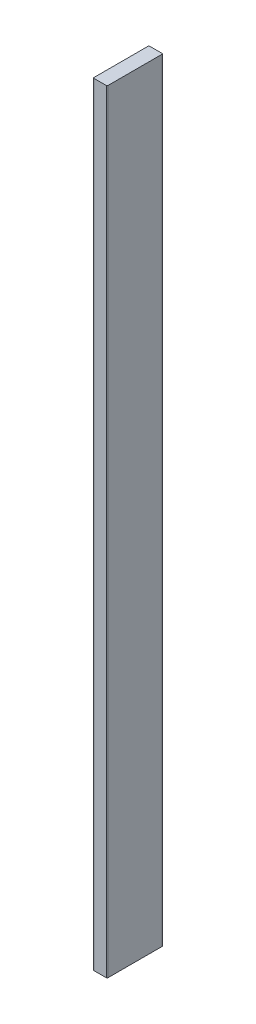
ISO-10303-21;
HEADER;
FILE_DESCRIPTION(('STEP AP214'),'2;1');
FILE_NAME('part.step','',(''),(''),'','','');
FILE_SCHEMA(('AUTOMOTIVE_DESIGN { 1 0 10303 214 1 1 1 1 }'));
ENDSEC;
DATA;
#1=APPLICATION_CONTEXT('core data for automotive mechanical design processes');
#2=APPLICATION_PROTOCOL_DEFINITION('international standard','automotive_design',2000,#1);
#3=PRODUCT_CONTEXT('',#1,'mechanical');
#4=PRODUCT('Part','Part','',(#3));
#5=PRODUCT_RELATED_PRODUCT_CATEGORY('part','',(#4));
#6=PRODUCT_DEFINITION_FORMATION('','',#4);
#7=PRODUCT_DEFINITION_CONTEXT('part definition',#1,'design');
#8=PRODUCT_DEFINITION('design','',#6,#7);
#9=PRODUCT_DEFINITION_SHAPE('','',#8);
#10=(LENGTH_UNIT() NAMED_UNIT(*) SI_UNIT(.MILLI.,.METRE.));
#11=(NAMED_UNIT(*) PLANE_ANGLE_UNIT() SI_UNIT($,.RADIAN.));
#12=(NAMED_UNIT(*) SI_UNIT($,.STERADIAN.) SOLID_ANGLE_UNIT());
#13=UNCERTAINTY_MEASURE_WITH_UNIT(LENGTH_MEASURE(1.E-05),#10,'distance_accuracy_value','');
#14=(GEOMETRIC_REPRESENTATION_CONTEXT(3) GLOBAL_UNCERTAINTY_ASSIGNED_CONTEXT((#13)) GLOBAL_UNIT_ASSIGNED_CONTEXT((#10,
#11,#12)) REPRESENTATION_CONTEXT('',''));
#15=CARTESIAN_POINT('',(0.,0.,0.));
#16=DIRECTION('',(0.,0.,1.));
#17=DIRECTION('',(1.,0.,0.));
#18=AXIS2_PLACEMENT_3D('',#15,#16,#17);
#19=CARTESIAN_POINT('',(-4.5,-277.5,19.5));
#20=DIRECTION('',(0.,1.,0.));
#21=DIRECTION('',(0.,0.,1.));
#22=AXIS2_PLACEMENT_3D('',#19,#20,#21);
#23=CYLINDRICAL_SURFACE('',#22,0.5);
#24=CARTESIAN_POINT('',(-4.5,277.5,19.5));
#25=DIRECTION('',(0.,1.,0.));
#26=DIRECTION('',(0.,0.,1.));
#27=AXIS2_PLACEMENT_3D('',#24,#25,#26);
#28=CIRCLE('',#27,0.5);
#29=CARTESIAN_POINT('',(-5.,277.5,19.5));
#30=VERTEX_POINT('',#29);
#31=CARTESIAN_POINT('',(-4.5,277.5,20.));
#32=VERTEX_POINT('',#31);
#33=EDGE_CURVE('E132',#30,#32,#28,.T.);
#34=ORIENTED_EDGE('',*,*,#33,.F.);
#35=DIRECTION('',(0.,1.,0.));
#36=VECTOR('',#35,1.);
#37=CARTESIAN_POINT('',(-5.,-277.5,19.5));
#38=LINE('',#37,#36);
#39=CARTESIAN_POINT('',(-5.,-277.5,19.5));
#40=VERTEX_POINT('',#39);
#41=EDGE_CURVE('E11',#40,#30,#38,.T.);
#42=ORIENTED_EDGE('',*,*,#41,.F.);
#43=CARTESIAN_POINT('',(-4.5,-277.5,19.5));
#44=DIRECTION('',(0.,1.,0.));
#45=DIRECTION('',(0.,0.,1.));
#46=AXIS2_PLACEMENT_3D('',#43,#44,#45);
#47=CIRCLE('',#46,0.5);
#48=CARTESIAN_POINT('',(-4.5,-277.5,20.));
#49=VERTEX_POINT('',#48);
#50=EDGE_CURVE('E152',#40,#49,#47,.T.);
#51=ORIENTED_EDGE('',*,*,#50,.T.);
#52=DIRECTION('',(0.,1.,0.));
#53=VECTOR('',#52,1.);
#54=CARTESIAN_POINT('',(-4.5,-277.5,20.));
#55=LINE('',#54,#53);
#56=EDGE_CURVE('E38',#49,#32,#55,.T.);
#57=ORIENTED_EDGE('',*,*,#56,.T.);
#58=EDGE_LOOP('',(#34,#42,#51,#57));
#59=FACE_BOUND('',#58,.T.);
#60=ADVANCED_FACE('F35',(#59),#23,.T.);
#61=CARTESIAN_POINT('',(-5.,-277.5,-19.5));
#62=DIRECTION('',(-1.,0.,0.));
#63=DIRECTION('',(0.,0.,1.));
#64=AXIS2_PLACEMENT_3D('',#61,#62,#63);
#65=PLANE('',#64);
#66=DIRECTION('',(0.,0.,1.));
#67=VECTOR('',#66,1.);
#68=CARTESIAN_POINT('',(-5.,277.5,-19.5));
#69=LINE('',#68,#67);
#70=CARTESIAN_POINT('',(-5.,277.5,-19.5));
#71=VERTEX_POINT('',#70);
#72=EDGE_CURVE('E150',#71,#30,#69,.T.);
#73=ORIENTED_EDGE('',*,*,#72,.F.);
#74=DIRECTION('',(0.,1.,0.));
#75=VECTOR('',#74,1.);
#76=CARTESIAN_POINT('',(-5.,-277.5,-19.5));
#77=LINE('',#76,#75);
#78=CARTESIAN_POINT('',(-5.,-277.5,-19.5));
#79=VERTEX_POINT('',#78);
#80=EDGE_CURVE('E44',#79,#71,#77,.T.);
#81=ORIENTED_EDGE('',*,*,#80,.F.);
#82=DIRECTION('',(0.,0.,1.));
#83=VECTOR('',#82,1.);
#84=CARTESIAN_POINT('',(-5.,-277.5,-19.5));
#85=LINE('',#84,#83);
#86=EDGE_CURVE('E122',#79,#40,#85,.T.);
#87=ORIENTED_EDGE('',*,*,#86,.T.);
#88=ORIENTED_EDGE('',*,*,#41,.T.);
#89=EDGE_LOOP('',(#73,#81,#87,#88));
#90=FACE_BOUND('',#89,.T.);
#91=ADVANCED_FACE('F164',(#90),#65,.T.);
#92=CARTESIAN_POINT('',(-4.5,-277.5,-19.5));
#93=DIRECTION('',(0.,1.,0.));
#94=DIRECTION('',(0.,0.,1.));
#95=AXIS2_PLACEMENT_3D('',#92,#93,#94);
#96=CYLINDRICAL_SURFACE('',#95,0.5);
#97=CARTESIAN_POINT('',(-4.5,277.5,-19.5));
#98=DIRECTION('',(0.,1.,0.));
#99=DIRECTION('',(0.,0.,1.));
#100=AXIS2_PLACEMENT_3D('',#97,#98,#99);
#101=CIRCLE('',#100,0.5);
#102=CARTESIAN_POINT('',(-4.5,277.5,-20.));
#103=VERTEX_POINT('',#102);
#104=EDGE_CURVE('E109',#103,#71,#101,.T.);
#105=ORIENTED_EDGE('',*,*,#104,.F.);
#106=DIRECTION('',(0.,1.,0.));
#107=VECTOR('',#106,1.);
#108=CARTESIAN_POINT('',(-4.5,-277.5,-20.));
#109=LINE('',#108,#107);
#110=CARTESIAN_POINT('',(-4.5,-277.5,-20.));
#111=VERTEX_POINT('',#110);
#112=EDGE_CURVE('E104',#111,#103,#109,.T.);
#113=ORIENTED_EDGE('',*,*,#112,.F.);
#114=CARTESIAN_POINT('',(-4.5,-277.5,-19.5));
#115=DIRECTION('',(0.,1.,0.));
#116=DIRECTION('',(0.,0.,1.));
#117=AXIS2_PLACEMENT_3D('',#114,#115,#116);
#118=CIRCLE('',#117,0.5);
#119=EDGE_CURVE('E107',#111,#79,#118,.T.);
#120=ORIENTED_EDGE('',*,*,#119,.T.);
#121=ORIENTED_EDGE('',*,*,#80,.T.);
#122=EDGE_LOOP('',(#105,#113,#120,#121));
#123=FACE_BOUND('',#122,.T.);
#124=ADVANCED_FACE('F106',(#123),#96,.T.);
#125=CARTESIAN_POINT('',(4.5,-277.5,-20.));
#126=DIRECTION('',(0.,0.,-1.));
#127=DIRECTION('',(-1.,0.,0.));
#128=AXIS2_PLACEMENT_3D('',#125,#126,#127);
#129=PLANE('',#128);
#130=DIRECTION('',(-1.,0.,0.));
#131=VECTOR('',#130,1.);
#132=CARTESIAN_POINT('',(4.5,277.5,-20.));
#133=LINE('',#132,#131);
#134=CARTESIAN_POINT('',(4.5,277.5,-20.));
#135=VERTEX_POINT('',#134);
#136=EDGE_CURVE('E147',#135,#103,#133,.T.);
#137=ORIENTED_EDGE('',*,*,#136,.F.);
#138=DIRECTION('',(0.,1.,0.));
#139=VECTOR('',#138,1.);
#140=CARTESIAN_POINT('',(4.5,-277.5,-20.));
#141=LINE('',#140,#139);
#142=CARTESIAN_POINT('',(4.5,-277.5,-20.));
#143=VERTEX_POINT('',#142);
#144=EDGE_CURVE('E114',#143,#135,#141,.T.);
#145=ORIENTED_EDGE('',*,*,#144,.F.);
#146=DIRECTION('',(-1.,0.,0.));
#147=VECTOR('',#146,1.);
#148=CARTESIAN_POINT('',(4.5,-277.5,-20.));
#149=LINE('',#148,#147);
#150=EDGE_CURVE('E120',#143,#111,#149,.T.);
#151=ORIENTED_EDGE('',*,*,#150,.T.);
#152=ORIENTED_EDGE('',*,*,#112,.T.);
#153=EDGE_LOOP('',(#137,#145,#151,#152));
#154=FACE_BOUND('',#153,.T.);
#155=ADVANCED_FACE('F124',(#154),#129,.T.);
#156=CARTESIAN_POINT('',(4.5,-277.5,-19.5));
#157=DIRECTION('',(0.,1.,0.));
#158=DIRECTION('',(0.,0.,1.));
#159=AXIS2_PLACEMENT_3D('',#156,#157,#158);
#160=CYLINDRICAL_SURFACE('',#159,0.5);
#161=CARTESIAN_POINT('',(4.5,277.5,-19.5));
#162=DIRECTION('',(0.,1.,0.));
#163=DIRECTION('',(0.,0.,1.));
#164=AXIS2_PLACEMENT_3D('',#161,#162,#163);
#165=CIRCLE('',#164,0.5);
#166=CARTESIAN_POINT('',(5.,277.5,-19.5));
#167=VERTEX_POINT('',#166);
#168=EDGE_CURVE('E144',#167,#135,#165,.T.);
#169=ORIENTED_EDGE('',*,*,#168,.F.);
#170=DIRECTION('',(0.,1.,0.));
#171=VECTOR('',#170,1.);
#172=CARTESIAN_POINT('',(5.,-277.5,-19.5));
#173=LINE('',#172,#171);
#174=CARTESIAN_POINT('',(5.,-277.5,-19.5));
#175=VERTEX_POINT('',#174);
#176=EDGE_CURVE('E156',#175,#167,#173,.T.);
#177=ORIENTED_EDGE('',*,*,#176,.F.);
#178=CARTESIAN_POINT('',(4.5,-277.5,-19.5));
#179=DIRECTION('',(0.,1.,0.));
#180=DIRECTION('',(0.,0.,1.));
#181=AXIS2_PLACEMENT_3D('',#178,#179,#180);
#182=CIRCLE('',#181,0.5);
#183=EDGE_CURVE('E125',#175,#143,#182,.T.);
#184=ORIENTED_EDGE('',*,*,#183,.T.);
#185=ORIENTED_EDGE('',*,*,#144,.T.);
#186=EDGE_LOOP('',(#169,#177,#184,#185));
#187=FACE_BOUND('',#186,.T.);
#188=ADVANCED_FACE('F177',(#187),#160,.T.);
#189=CARTESIAN_POINT('',(5.,-277.5,19.5));
#190=DIRECTION('',(1.,0.,0.));
#191=DIRECTION('',(0.,0.,-1.));
#192=AXIS2_PLACEMENT_3D('',#189,#190,#191);
#193=PLANE('',#192);
#194=DIRECTION('',(0.,0.,-1.));
#195=VECTOR('',#194,1.);
#196=CARTESIAN_POINT('',(5.,277.5,19.5));
#197=LINE('',#196,#195);
#198=CARTESIAN_POINT('',(5.,277.5,19.5));
#199=VERTEX_POINT('',#198);
#200=EDGE_CURVE('E141',#199,#167,#197,.T.);
#201=ORIENTED_EDGE('',*,*,#200,.F.);
#202=DIRECTION('',(0.,1.,0.));
#203=VECTOR('',#202,1.);
#204=CARTESIAN_POINT('',(5.,-277.5,19.5));
#205=LINE('',#204,#203);
#206=CARTESIAN_POINT('',(5.,-277.5,19.5));
#207=VERTEX_POINT('',#206);
#208=EDGE_CURVE('E158',#207,#199,#205,.T.);
#209=ORIENTED_EDGE('',*,*,#208,.F.);
#210=DIRECTION('',(0.,0.,-1.));
#211=VECTOR('',#210,1.);
#212=CARTESIAN_POINT('',(5.,-277.5,19.5));
#213=LINE('',#212,#211);
#214=EDGE_CURVE('E127',#207,#175,#213,.T.);
#215=ORIENTED_EDGE('',*,*,#214,.T.);
#216=ORIENTED_EDGE('',*,*,#176,.T.);
#217=EDGE_LOOP('',(#201,#209,#215,#216));
#218=FACE_BOUND('',#217,.T.);
#219=ADVANCED_FACE('F180',(#218),#193,.T.);
#220=CARTESIAN_POINT('',(4.5,-277.5,19.5));
#221=DIRECTION('',(0.,1.,0.));
#222=DIRECTION('',(0.,0.,1.));
#223=AXIS2_PLACEMENT_3D('',#220,#221,#222);
#224=CYLINDRICAL_SURFACE('',#223,0.5);
#225=CARTESIAN_POINT('',(4.5,277.5,19.5));
#226=DIRECTION('',(0.,1.,0.));
#227=DIRECTION('',(0.,0.,1.));
#228=AXIS2_PLACEMENT_3D('',#225,#226,#227);
#229=CIRCLE('',#228,0.5);
#230=CARTESIAN_POINT('',(4.5,277.5,20.));
#231=VERTEX_POINT('',#230);
#232=EDGE_CURVE('E138',#231,#199,#229,.T.);
#233=ORIENTED_EDGE('',*,*,#232,.F.);
#234=DIRECTION('',(0.,1.,0.));
#235=VECTOR('',#234,1.);
#236=CARTESIAN_POINT('',(4.5,-277.5,20.));
#237=LINE('',#236,#235);
#238=CARTESIAN_POINT('',(4.5,-277.5,20.));
#239=VERTEX_POINT('',#238);
#240=EDGE_CURVE('E159',#239,#231,#237,.T.);
#241=ORIENTED_EDGE('',*,*,#240,.F.);
#242=CARTESIAN_POINT('',(4.5,-277.5,19.5));
#243=DIRECTION('',(0.,1.,0.));
#244=DIRECTION('',(0.,0.,1.));
#245=AXIS2_PLACEMENT_3D('',#242,#243,#244);
#246=CIRCLE('',#245,0.5);
#247=EDGE_CURVE('E255',#239,#207,#246,.T.);
#248=ORIENTED_EDGE('',*,*,#247,.T.);
#249=ORIENTED_EDGE('',*,*,#208,.T.);
#250=EDGE_LOOP('',(#233,#241,#248,#249));
#251=FACE_BOUND('',#250,.T.);
#252=ADVANCED_FACE('F184',(#251),#224,.T.);
#253=CARTESIAN_POINT('',(-4.5,-277.5,20.));
#254=DIRECTION('',(0.,0.,1.));
#255=DIRECTION('',(1.,0.,0.));
#256=AXIS2_PLACEMENT_3D('',#253,#254,#255);
#257=PLANE('',#256);
#258=DIRECTION('',(1.,0.,0.));
#259=VECTOR('',#258,1.);
#260=CARTESIAN_POINT('',(-4.5,277.5,20.));
#261=LINE('',#260,#259);
#262=EDGE_CURVE('E135',#32,#231,#261,.T.);
#263=ORIENTED_EDGE('',*,*,#262,.F.);
#264=ORIENTED_EDGE('',*,*,#56,.F.);
#265=DIRECTION('',(1.,0.,0.));
#266=VECTOR('',#265,1.);
#267=CARTESIAN_POINT('',(-4.5,-277.5,20.));
#268=LINE('',#267,#266);
#269=EDGE_CURVE('E256',#49,#239,#268,.T.);
#270=ORIENTED_EDGE('',*,*,#269,.T.);
#271=ORIENTED_EDGE('',*,*,#240,.T.);
#272=EDGE_LOOP('',(#263,#264,#270,#271));
#273=FACE_BOUND('',#272,.T.);
#274=ADVANCED_FACE('F161',(#273),#257,.T.);
#275=CARTESIAN_POINT('',(-4.5,-277.5,19.5));
#276=DIRECTION('',(0.,1.,0.));
#277=DIRECTION('',(0.,0.,1.));
#278=AXIS2_PLACEMENT_3D('',#275,#276,#277);
#279=PLANE('',#278);
#280=ORIENTED_EDGE('',*,*,#50,.F.);
#281=ORIENTED_EDGE('',*,*,#86,.F.);
#282=ORIENTED_EDGE('',*,*,#119,.F.);
#283=ORIENTED_EDGE('',*,*,#150,.F.);
#284=ORIENTED_EDGE('',*,*,#183,.F.);
#285=ORIENTED_EDGE('',*,*,#214,.F.);
#286=ORIENTED_EDGE('',*,*,#247,.F.);
#287=ORIENTED_EDGE('',*,*,#269,.F.);
#288=EDGE_LOOP('',(#280,#281,#282,#283,#284,#285,#286,#287));
#289=FACE_BOUND('',#288,.T.);
#290=ADVANCED_FACE('F118',(#289),#279,.F.);
#291=CARTESIAN_POINT('',(-4.5,277.5,19.5));
#292=DIRECTION('',(0.,1.,0.));
#293=DIRECTION('',(0.,0.,1.));
#294=AXIS2_PLACEMENT_3D('',#291,#292,#293);
#295=PLANE('',#294);
#296=ORIENTED_EDGE('',*,*,#33,.T.);
#297=ORIENTED_EDGE('',*,*,#262,.T.);
#298=ORIENTED_EDGE('',*,*,#232,.T.);
#299=ORIENTED_EDGE('',*,*,#200,.T.);
#300=ORIENTED_EDGE('',*,*,#168,.T.);
#301=ORIENTED_EDGE('',*,*,#136,.T.);
#302=ORIENTED_EDGE('',*,*,#104,.T.);
#303=ORIENTED_EDGE('',*,*,#72,.T.);
#304=EDGE_LOOP('',(#296,#297,#298,#299,#300,#301,#302,#303));
#305=FACE_BOUND('',#304,.T.);
#306=ADVANCED_FACE('F163',(#305),#295,.T.);
#307=CLOSED_SHELL('',(#60,#91,#124,#155,#188,#219,#252,#274,#290,#306));
#308=MANIFOLD_SOLID_BREP('B2',#307);
#309=ADVANCED_BREP_SHAPE_REPRESENTATION('',(#18,#308),#14);
#310=SHAPE_DEFINITION_REPRESENTATION(#9,#309);
ENDSEC;
END-ISO-10303-21;
